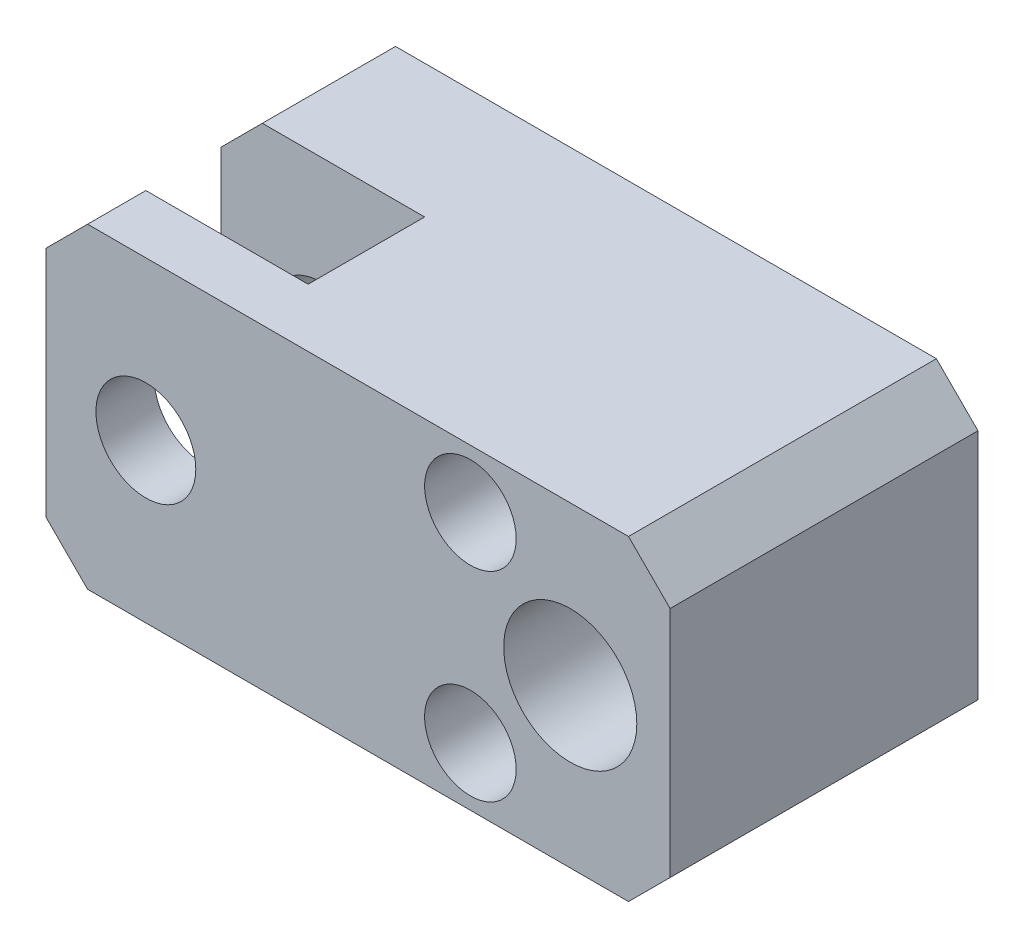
ISO-10303-21;
HEADER;
FILE_DESCRIPTION(('STEP AP214'),'2;1');
FILE_NAME('part.step','',(''),(''),'','','');
FILE_SCHEMA(('AUTOMOTIVE_DESIGN { 1 0 10303 214 1 1 1 1 }'));
ENDSEC;
DATA;
#1=APPLICATION_CONTEXT('core data for automotive mechanical design processes');
#2=APPLICATION_PROTOCOL_DEFINITION('international standard','automotive_design',2000,#1);
#3=PRODUCT_CONTEXT('',#1,'mechanical');
#4=PRODUCT('Part','Part','',(#3));
#5=PRODUCT_RELATED_PRODUCT_CATEGORY('part','',(#4));
#6=PRODUCT_DEFINITION_FORMATION('','',#4);
#7=PRODUCT_DEFINITION_CONTEXT('part definition',#1,'design');
#8=PRODUCT_DEFINITION('design','',#6,#7);
#9=PRODUCT_DEFINITION_SHAPE('','',#8);
#10=(LENGTH_UNIT() NAMED_UNIT(*) SI_UNIT(.MILLI.,.METRE.));
#11=(NAMED_UNIT(*) PLANE_ANGLE_UNIT() SI_UNIT($,.RADIAN.));
#12=(NAMED_UNIT(*) SI_UNIT($,.STERADIAN.) SOLID_ANGLE_UNIT());
#13=UNCERTAINTY_MEASURE_WITH_UNIT(LENGTH_MEASURE(1.E-05),#10,'distance_accuracy_value','');
#14=(GEOMETRIC_REPRESENTATION_CONTEXT(3) GLOBAL_UNCERTAINTY_ASSIGNED_CONTEXT((#13)) GLOBAL_UNIT_ASSIGNED_CONTEXT((#10,
#11,#12)) REPRESENTATION_CONTEXT('',''));
#15=CARTESIAN_POINT('',(0.,0.,0.));
#16=DIRECTION('',(0.,0.,1.));
#17=DIRECTION('',(1.,0.,0.));
#18=AXIS2_PLACEMENT_3D('',#15,#16,#17);
#19=CARTESIAN_POINT('',(-26.5,31.,30.));
#20=DIRECTION('',(1.,0.,0.));
#21=DIRECTION('',(0.,1.,0.));
#22=AXIS2_PLACEMENT_3D('',#19,#20,#21);
#23=PLANE('',#22);
#24=DIRECTION('',(0.,0.,1.));
#25=VECTOR('',#24,1.);
#26=CARTESIAN_POINT('',(-26.5,-7.,30.));
#27=LINE('',#26,#25);
#28=CARTESIAN_POINT('',(-26.5,-7.,16.));
#29=VERTEX_POINT('',#28);
#30=CARTESIAN_POINT('',(-26.5,-7.,30.));
#31=VERTEX_POINT('',#30);
#32=EDGE_CURVE('E127',#29,#31,#27,.T.);
#33=ORIENTED_EDGE('',*,*,#32,.T.);
#34=DIRECTION('',(0.,-1.,0.));
#35=VECTOR('',#34,1.);
#36=CARTESIAN_POINT('',(-26.5,31.,30.));
#37=LINE('',#36,#35);
#38=CARTESIAN_POINT('',(-26.5,31.,30.));
#39=VERTEX_POINT('',#38);
#40=EDGE_CURVE('E135',#39,#31,#37,.T.);
#41=ORIENTED_EDGE('',*,*,#40,.F.);
#42=DIRECTION('',(0.,0.,1.));
#43=VECTOR('',#42,1.);
#44=CARTESIAN_POINT('',(-26.5,31.,30.));
#45=LINE('',#44,#43);
#46=CARTESIAN_POINT('',(-26.5,31.,16.));
#47=VERTEX_POINT('',#46);
#48=EDGE_CURVE('E134',#47,#39,#45,.T.);
#49=ORIENTED_EDGE('',*,*,#48,.F.);
#50=DIRECTION('',(0.,-1.,0.));
#51=VECTOR('',#50,1.);
#52=CARTESIAN_POINT('',(-26.5,31.,16.));
#53=LINE('',#52,#51);
#54=EDGE_CURVE('E119',#47,#29,#53,.T.);
#55=ORIENTED_EDGE('',*,*,#54,.T.);
#56=EDGE_LOOP('',(#33,#41,#49,#55));
#57=FACE_BOUND('',#56,.T.);
#58=ADVANCED_FACE('F14',(#57),#23,.F.);
#59=CARTESIAN_POINT('',(-51.,31.,0.));
#60=DIRECTION('',(-1.,0.,0.));
#61=DIRECTION('',(0.,-1.,0.));
#62=AXIS2_PLACEMENT_3D('',#59,#60,#61);
#63=PLANE('',#62);
#64=DIRECTION('',(0.,-1.,0.));
#65=VECTOR('',#64,1.);
#66=CARTESIAN_POINT('',(-51.,-7.,37.));
#67=LINE('',#66,#65);
#68=CARTESIAN_POINT('',(-51.,26.,37.));
#69=VERTEX_POINT('',#68);
#70=CARTESIAN_POINT('',(-51.,-2.,37.));
#71=VERTEX_POINT('',#70);
#72=EDGE_CURVE('E159',#69,#71,#67,.T.);
#73=ORIENTED_EDGE('',*,*,#72,.F.);
#74=DIRECTION('',(0.,0.,-1.));
#75=VECTOR('',#74,1.);
#76=CARTESIAN_POINT('',(-51.,26.,30.));
#77=LINE('',#76,#75);
#78=CARTESIAN_POINT('',(-51.,26.,30.));
#79=VERTEX_POINT('',#78);
#80=EDGE_CURVE('E35',#69,#79,#77,.T.);
#81=ORIENTED_EDGE('',*,*,#80,.T.);
#82=DIRECTION('',(0.,-1.,0.));
#83=VECTOR('',#82,1.);
#84=CARTESIAN_POINT('',(-51.,31.,30.));
#85=LINE('',#84,#83);
#86=CARTESIAN_POINT('',(-51.,-2.,30.));
#87=VERTEX_POINT('',#86);
#88=EDGE_CURVE('E149',#79,#87,#85,.T.);
#89=ORIENTED_EDGE('',*,*,#88,.T.);
#90=DIRECTION('',(0.,0.,1.));
#91=VECTOR('',#90,1.);
#92=CARTESIAN_POINT('',(-51.,-2.,37.));
#93=LINE('',#92,#91);
#94=EDGE_CURVE('E228',#87,#71,#93,.T.);
#95=ORIENTED_EDGE('',*,*,#94,.T.);
#96=EDGE_LOOP('',(#73,#81,#89,#95));
#97=FACE_BOUND('',#96,.T.);
#98=ADVANCED_FACE('F231',(#97),#63,.T.);
#99=CARTESIAN_POINT('',(24.,-7.,0.));
#100=DIRECTION('',(0.,0.,1.));
#101=DIRECTION('',(1.,0.,0.));
#102=AXIS2_PLACEMENT_3D('',#99,#100,#101);
#103=PLANE('',#102);
#104=CARTESIAN_POINT('',(0.,24.,0.));
#105=DIRECTION('',(0.,0.,1.));
#106=DIRECTION('',(1.,0.,0.));
#107=AXIS2_PLACEMENT_3D('',#104,#105,#106);
#108=CIRCLE('',#107,3.3);
#109=CARTESIAN_POINT('',(3.3,24.,0.));
#110=VERTEX_POINT('',#109);
#111=EDGE_CURVE('E270',#110,#110,#108,.T.);
#112=ORIENTED_EDGE('',*,*,#111,.T.);
#113=EDGE_LOOP('',(#112));
#114=FACE_BOUND('',#113,.T.);
#115=CARTESIAN_POINT('',(0.,0.,0.));
#116=DIRECTION('',(0.,0.,1.));
#117=DIRECTION('',(1.,0.,0.));
#118=AXIS2_PLACEMENT_3D('',#115,#116,#117);
#119=CIRCLE('',#118,3.3);
#120=CARTESIAN_POINT('',(3.3,0.,0.));
#121=VERTEX_POINT('',#120);
#122=EDGE_CURVE('E258',#121,#121,#119,.T.);
#123=ORIENTED_EDGE('',*,*,#122,.T.);
#124=EDGE_LOOP('',(#123));
#125=FACE_BOUND('',#124,.T.);
#126=DIRECTION('',(-1.,0.,0.));
#127=VECTOR('',#126,1.);
#128=CARTESIAN_POINT('',(24.,-7.,0.));
#129=LINE('',#128,#127);
#130=CARTESIAN_POINT('',(19.,-7.,0.));
#131=VERTEX_POINT('',#130);
#132=CARTESIAN_POINT('',(-46.,-7.,0.));
#133=VERTEX_POINT('',#132);
#134=EDGE_CURVE('E168',#131,#133,#129,.T.);
#135=ORIENTED_EDGE('',*,*,#134,.T.);
#136=DIRECTION('',(-0.707106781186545,0.70710678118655,0.));
#137=VECTOR('',#136,1.);
#138=CARTESIAN_POINT('',(-46.,-7.,0.));
#139=LINE('',#138,#137);
#140=CARTESIAN_POINT('',(-51.,-2.,0.));
#141=VERTEX_POINT('',#140);
#142=EDGE_CURVE('E197',#133,#141,#139,.T.);
#143=ORIENTED_EDGE('',*,*,#142,.T.);
#144=DIRECTION('',(0.,1.,0.));
#145=VECTOR('',#144,1.);
#146=CARTESIAN_POINT('',(-51.,-7.,0.));
#147=LINE('',#146,#145);
#148=CARTESIAN_POINT('',(-51.,26.,0.));
#149=VERTEX_POINT('',#148);
#150=EDGE_CURVE('E156',#141,#149,#147,.T.);
#151=ORIENTED_EDGE('',*,*,#150,.T.);
#152=DIRECTION('',(0.707106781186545,0.70710678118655,0.));
#153=VECTOR('',#152,1.);
#154=CARTESIAN_POINT('',(-46.,31.,0.));
#155=LINE('',#154,#153);
#156=CARTESIAN_POINT('',(-46.,31.,0.));
#157=VERTEX_POINT('',#156);
#158=EDGE_CURVE('E191',#149,#157,#155,.T.);
#159=ORIENTED_EDGE('',*,*,#158,.T.);
#160=DIRECTION('',(-1.,0.,0.));
#161=VECTOR('',#160,1.);
#162=CARTESIAN_POINT('',(24.,31.,0.));
#163=LINE('',#162,#161);
#164=CARTESIAN_POINT('',(19.,31.,0.));
#165=VERTEX_POINT('',#164);
#166=EDGE_CURVE('E177',#165,#157,#163,.T.);
#167=ORIENTED_EDGE('',*,*,#166,.F.);
#168=DIRECTION('',(-0.707106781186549,0.707106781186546,0.));
#169=VECTOR('',#168,1.);
#170=CARTESIAN_POINT('',(24.,26.,0.));
#171=LINE('',#170,#169);
#172=CARTESIAN_POINT('',(24.,26.,0.));
#173=VERTEX_POINT('',#172);
#174=EDGE_CURVE('E193',#165,#173,#171,.F.);
#175=ORIENTED_EDGE('',*,*,#174,.T.);
#176=DIRECTION('',(0.,1.,0.));
#177=VECTOR('',#176,1.);
#178=CARTESIAN_POINT('',(24.,-7.,0.));
#179=LINE('',#178,#177);
#180=CARTESIAN_POINT('',(24.,-2.,0.));
#181=VERTEX_POINT('',#180);
#182=EDGE_CURVE('E162',#181,#173,#179,.T.);
#183=ORIENTED_EDGE('',*,*,#182,.F.);
#184=DIRECTION('',(0.707106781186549,0.707106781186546,0.));
#185=VECTOR('',#184,1.);
#186=CARTESIAN_POINT('',(24.,-2.,0.));
#187=LINE('',#186,#185);
#188=EDGE_CURVE('E195',#181,#131,#187,.F.);
#189=ORIENTED_EDGE('',*,*,#188,.T.);
#190=EDGE_LOOP('',(#135,#143,#151,#159,#167,#175,#183,#189));
#191=FACE_BOUND('',#190,.T.);
#192=ADVANCED_FACE('F16',(#114,#125,#191),#103,.F.);
#193=CARTESIAN_POINT('',(24.,31.,37.));
#194=DIRECTION('',(0.,-1.,0.));
#195=DIRECTION('',(0.,0.,-1.));
#196=AXIS2_PLACEMENT_3D('',#193,#194,#195);
#197=PLANE('',#196);
#198=DIRECTION('',(-1.,0.,0.));
#199=VECTOR('',#198,1.);
#200=CARTESIAN_POINT('',(24.,31.,37.));
#201=LINE('',#200,#199);
#202=CARTESIAN_POINT('',(19.,31.,37.));
#203=VERTEX_POINT('',#202);
#204=CARTESIAN_POINT('',(-46.,31.,37.));
#205=VERTEX_POINT('',#204);
#206=EDGE_CURVE('E174',#203,#205,#201,.T.);
#207=ORIENTED_EDGE('',*,*,#206,.F.);
#208=DIRECTION('',(0.,0.,-1.));
#209=VECTOR('',#208,1.);
#210=CARTESIAN_POINT('',(19.,31.,37.));
#211=LINE('',#210,#209);
#212=EDGE_CURVE('E226',#203,#165,#211,.T.);
#213=ORIENTED_EDGE('',*,*,#212,.T.);
#214=ORIENTED_EDGE('',*,*,#166,.T.);
#215=DIRECTION('',(0.,0.,1.));
#216=VECTOR('',#215,1.);
#217=CARTESIAN_POINT('',(-46.,31.,16.));
#218=LINE('',#217,#216);
#219=CARTESIAN_POINT('',(-46.,31.,16.));
#220=VERTEX_POINT('',#219);
#221=EDGE_CURVE('E223',#157,#220,#218,.T.);
#222=ORIENTED_EDGE('',*,*,#221,.T.);
#223=DIRECTION('',(1.,0.,0.));
#224=VECTOR('',#223,1.);
#225=CARTESIAN_POINT('',(-51.,31.,16.));
#226=LINE('',#225,#224);
#227=EDGE_CURVE('E143',#220,#47,#226,.T.);
#228=ORIENTED_EDGE('',*,*,#227,.T.);
#229=ORIENTED_EDGE('',*,*,#48,.T.);
#230=DIRECTION('',(-1.,0.,0.));
#231=VECTOR('',#230,1.);
#232=CARTESIAN_POINT('',(-51.,31.,30.));
#233=LINE('',#232,#231);
#234=CARTESIAN_POINT('',(-46.,31.,30.));
#235=VERTEX_POINT('',#234);
#236=EDGE_CURVE('E140',#39,#235,#233,.T.);
#237=ORIENTED_EDGE('',*,*,#236,.T.);
#238=DIRECTION('',(0.,0.,1.));
#239=VECTOR('',#238,1.);
#240=CARTESIAN_POINT('',(-46.,31.,37.));
#241=LINE('',#240,#239);
#242=EDGE_CURVE('E220',#235,#205,#241,.T.);
#243=ORIENTED_EDGE('',*,*,#242,.T.);
#244=EDGE_LOOP('',(#207,#213,#214,#222,#228,#229,#237,#243));
#245=FACE_BOUND('',#244,.T.);
#246=ADVANCED_FACE('F332',(#245),#197,.F.);
#247=CARTESIAN_POINT('',(24.,-7.,37.));
#248=DIRECTION('',(0.,0.,-1.));
#249=DIRECTION('',(-1.,0.,0.));
#250=AXIS2_PLACEMENT_3D('',#247,#248,#249);
#251=PLANE('',#250);
#252=CARTESIAN_POINT('',(0.,24.,37.));
#253=DIRECTION('',(0.,0.,1.));
#254=DIRECTION('',(1.,0.,0.));
#255=AXIS2_PLACEMENT_3D('',#252,#253,#254);
#256=CIRCLE('',#255,5.5);
#257=CARTESIAN_POINT('',(5.5,24.,37.));
#258=VERTEX_POINT('',#257);
#259=EDGE_CURVE('E261',#258,#258,#256,.T.);
#260=ORIENTED_EDGE('',*,*,#259,.F.);
#261=EDGE_LOOP('',(#260));
#262=FACE_BOUND('',#261,.T.);
#263=CARTESIAN_POINT('',(0.,0.,37.));
#264=DIRECTION('',(0.,0.,1.));
#265=DIRECTION('',(1.,0.,0.));
#266=AXIS2_PLACEMENT_3D('',#263,#264,#265);
#267=CIRCLE('',#266,5.5);
#268=CARTESIAN_POINT('',(5.5,0.,37.));
#269=VERTEX_POINT('',#268);
#270=EDGE_CURVE('E249',#269,#269,#267,.T.);
#271=ORIENTED_EDGE('',*,*,#270,.F.);
#272=EDGE_LOOP('',(#271));
#273=FACE_BOUND('',#272,.T.);
#274=CARTESIAN_POINT('',(-39.,12.,37.));
#275=DIRECTION('',(0.,0.,1.));
#276=DIRECTION('',(1.,0.,0.));
#277=AXIS2_PLACEMENT_3D('',#274,#275,#276);
#278=CIRCLE('',#277,6.);
#279=CARTESIAN_POINT('',(-33.,12.,37.));
#280=VERTEX_POINT('',#279);
#281=EDGE_CURVE('E246',#280,#280,#278,.T.);
#282=ORIENTED_EDGE('',*,*,#281,.F.);
#283=EDGE_LOOP('',(#282));
#284=FACE_BOUND('',#283,.T.);
#285=CARTESIAN_POINT('',(12.,12.,37.));
#286=DIRECTION('',(0.,0.,1.));
#287=DIRECTION('',(1.,0.,0.));
#288=AXIS2_PLACEMENT_3D('',#285,#286,#287);
#289=CIRCLE('',#288,8.);
#290=CARTESIAN_POINT('',(20.,12.,37.));
#291=VERTEX_POINT('',#290);
#292=EDGE_CURVE('E150',#291,#291,#289,.T.);
#293=ORIENTED_EDGE('',*,*,#292,.F.);
#294=EDGE_LOOP('',(#293));
#295=FACE_BOUND('',#294,.T.);
#296=DIRECTION('',(-1.,0.,0.));
#297=VECTOR('',#296,1.);
#298=CARTESIAN_POINT('',(24.,-7.,37.));
#299=LINE('',#298,#297);
#300=CARTESIAN_POINT('',(19.,-7.,37.));
#301=VERTEX_POINT('',#300);
#302=CARTESIAN_POINT('',(-46.,-7.,37.));
#303=VERTEX_POINT('',#302);
#304=EDGE_CURVE('E171',#301,#303,#299,.T.);
#305=ORIENTED_EDGE('',*,*,#304,.F.);
#306=DIRECTION('',(-0.707106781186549,-0.707106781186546,0.));
#307=VECTOR('',#306,1.);
#308=CARTESIAN_POINT('',(24.,-2.,37.));
#309=LINE('',#308,#307);
#310=CARTESIAN_POINT('',(24.,-2.,37.));
#311=VERTEX_POINT('',#310);
#312=EDGE_CURVE('E218',#301,#311,#309,.F.);
#313=ORIENTED_EDGE('',*,*,#312,.T.);
#314=DIRECTION('',(0.,-1.,0.));
#315=VECTOR('',#314,1.);
#316=CARTESIAN_POINT('',(24.,-7.,37.));
#317=LINE('',#316,#315);
#318=CARTESIAN_POINT('',(24.,26.,37.));
#319=VERTEX_POINT('',#318);
#320=EDGE_CURVE('E165',#319,#311,#317,.T.);
#321=ORIENTED_EDGE('',*,*,#320,.F.);
#322=DIRECTION('',(0.707106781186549,-0.707106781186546,0.));
#323=VECTOR('',#322,1.);
#324=CARTESIAN_POINT('',(24.,26.,37.));
#325=LINE('',#324,#323);
#326=EDGE_CURVE('E216',#319,#203,#325,.F.);
#327=ORIENTED_EDGE('',*,*,#326,.T.);
#328=ORIENTED_EDGE('',*,*,#206,.T.);
#329=DIRECTION('',(-0.707106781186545,-0.70710678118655,0.));
#330=VECTOR('',#329,1.);
#331=CARTESIAN_POINT('',(-46.,31.,37.));
#332=LINE('',#331,#330);
#333=EDGE_CURVE('E214',#205,#69,#332,.T.);
#334=ORIENTED_EDGE('',*,*,#333,.T.);
#335=ORIENTED_EDGE('',*,*,#72,.T.);
#336=DIRECTION('',(0.707106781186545,-0.70710678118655,0.));
#337=VECTOR('',#336,1.);
#338=CARTESIAN_POINT('',(-46.,-7.,37.));
#339=LINE('',#338,#337);
#340=EDGE_CURVE('E212',#71,#303,#339,.T.);
#341=ORIENTED_EDGE('',*,*,#340,.T.);
#342=EDGE_LOOP('',(#305,#313,#321,#327,#328,#334,#335,#341));
#343=FACE_BOUND('',#342,.T.);
#344=ADVANCED_FACE('F236',(#262,#273,#284,#295,#343),#251,.F.);
#345=CARTESIAN_POINT('',(24.,-7.,37.));
#346=DIRECTION('',(0.,1.,0.));
#347=DIRECTION('',(0.,0.,1.));
#348=AXIS2_PLACEMENT_3D('',#345,#346,#347);
#349=PLANE('',#348);
#350=DIRECTION('',(1.,0.,0.));
#351=VECTOR('',#350,1.);
#352=CARTESIAN_POINT('',(-51.,-7.,16.));
#353=LINE('',#352,#351);
#354=CARTESIAN_POINT('',(-46.,-7.,16.));
#355=VERTEX_POINT('',#354);
#356=EDGE_CURVE('E114',#355,#29,#353,.T.);
#357=ORIENTED_EDGE('',*,*,#356,.F.);
#358=DIRECTION('',(0.,0.,-1.));
#359=VECTOR('',#358,1.);
#360=CARTESIAN_POINT('',(-46.,-7.,0.));
#361=LINE('',#360,#359);
#362=EDGE_CURVE('E189',#355,#133,#361,.T.);
#363=ORIENTED_EDGE('',*,*,#362,.T.);
#364=ORIENTED_EDGE('',*,*,#134,.F.);
#365=DIRECTION('',(0.,0.,1.));
#366=VECTOR('',#365,1.);
#367=CARTESIAN_POINT('',(19.,-7.,37.));
#368=LINE('',#367,#366);
#369=EDGE_CURVE('E187',#131,#301,#368,.T.);
#370=ORIENTED_EDGE('',*,*,#369,.T.);
#371=ORIENTED_EDGE('',*,*,#304,.T.);
#372=DIRECTION('',(0.,0.,-1.));
#373=VECTOR('',#372,1.);
#374=CARTESIAN_POINT('',(-46.,-7.,30.));
#375=LINE('',#374,#373);
#376=CARTESIAN_POINT('',(-46.,-7.,30.));
#377=VERTEX_POINT('',#376);
#378=EDGE_CURVE('E180',#303,#377,#375,.T.);
#379=ORIENTED_EDGE('',*,*,#378,.T.);
#380=DIRECTION('',(-1.,0.,0.));
#381=VECTOR('',#380,1.);
#382=CARTESIAN_POINT('',(-51.,-7.,30.));
#383=LINE('',#382,#381);
#384=EDGE_CURVE('E128',#31,#377,#383,.T.);
#385=ORIENTED_EDGE('',*,*,#384,.F.);
#386=ORIENTED_EDGE('',*,*,#32,.F.);
#387=EDGE_LOOP('',(#357,#363,#364,#370,#371,#379,#385,#386));
#388=FACE_BOUND('',#387,.T.);
#389=ADVANCED_FACE('F138',(#388),#349,.F.);
#390=CARTESIAN_POINT('',(24.,31.,0.));
#391=DIRECTION('',(-1.,0.,0.));
#392=DIRECTION('',(0.,-1.,0.));
#393=AXIS2_PLACEMENT_3D('',#390,#391,#392);
#394=PLANE('',#393);
#395=ORIENTED_EDGE('',*,*,#320,.T.);
#396=DIRECTION('',(0.,0.,-1.));
#397=VECTOR('',#396,1.);
#398=CARTESIAN_POINT('',(24.,-2.,0.));
#399=LINE('',#398,#397);
#400=EDGE_CURVE('E209',#311,#181,#399,.T.);
#401=ORIENTED_EDGE('',*,*,#400,.T.);
#402=ORIENTED_EDGE('',*,*,#182,.T.);
#403=DIRECTION('',(0.,0.,1.));
#404=VECTOR('',#403,1.);
#405=CARTESIAN_POINT('',(24.,26.,0.));
#406=LINE('',#405,#404);
#407=EDGE_CURVE('E206',#173,#319,#406,.T.);
#408=ORIENTED_EDGE('',*,*,#407,.T.);
#409=EDGE_LOOP('',(#395,#401,#402,#408));
#410=FACE_BOUND('',#409,.T.);
#411=ADVANCED_FACE('F341',(#410),#394,.F.);
#412=ORIENTED_EDGE('',*,*,#150,.F.);
#413=DIRECTION('',(0.,0.,1.));
#414=VECTOR('',#413,1.);
#415=CARTESIAN_POINT('',(-51.,-2.,16.));
#416=LINE('',#415,#414);
#417=CARTESIAN_POINT('',(-51.,-2.,16.));
#418=VERTEX_POINT('',#417);
#419=EDGE_CURVE('E201',#141,#418,#416,.T.);
#420=ORIENTED_EDGE('',*,*,#419,.T.);
#421=DIRECTION('',(0.,-1.,0.));
#422=VECTOR('',#421,1.);
#423=CARTESIAN_POINT('',(-51.,31.,16.));
#424=LINE('',#423,#422);
#425=CARTESIAN_POINT('',(-51.,26.,16.));
#426=VERTEX_POINT('',#425);
#427=EDGE_CURVE('E136',#426,#418,#424,.T.);
#428=ORIENTED_EDGE('',*,*,#427,.F.);
#429=DIRECTION('',(0.,0.,-1.));
#430=VECTOR('',#429,1.);
#431=CARTESIAN_POINT('',(-51.,26.,0.));
#432=LINE('',#431,#430);
#433=EDGE_CURVE('E199',#426,#149,#432,.T.);
#434=ORIENTED_EDGE('',*,*,#433,.T.);
#435=EDGE_LOOP('',(#412,#420,#428,#434));
#436=FACE_BOUND('',#435,.T.);
#437=ADVANCED_FACE('F298',(#436),#63,.T.);
#438=CARTESIAN_POINT('',(12.,12.,7.));
#439=DIRECTION('',(0.,0.,1.));
#440=DIRECTION('',(1.,0.,0.));
#441=AXIS2_PLACEMENT_3D('',#438,#439,#440);
#442=CYLINDRICAL_SURFACE('',#441,8.);
#443=ORIENTED_EDGE('',*,*,#292,.T.);
#444=EDGE_LOOP('',(#443));
#445=FACE_BOUND('',#444,.T.);
#446=CARTESIAN_POINT('',(12.,12.,7.));
#447=DIRECTION('',(0.,0.,1.));
#448=DIRECTION('',(1.,0.,0.));
#449=AXIS2_PLACEMENT_3D('',#446,#447,#448);
#450=CIRCLE('',#449,8.);
#451=CARTESIAN_POINT('',(20.,12.,7.));
#452=VERTEX_POINT('',#451);
#453=EDGE_CURVE('E273',#452,#452,#450,.F.);
#454=ORIENTED_EDGE('',*,*,#453,.T.);
#455=EDGE_LOOP('',(#454));
#456=FACE_BOUND('',#455,.T.);
#457=ADVANCED_FACE('F277',(#445,#456),#442,.F.);
#458=CARTESIAN_POINT('',(-51.,31.,30.));
#459=DIRECTION('',(0.,0.,1.));
#460=DIRECTION('',(0.,-1.,0.));
#461=AXIS2_PLACEMENT_3D('',#458,#459,#460);
#462=PLANE('',#461);
#463=CARTESIAN_POINT('',(-39.,12.,30.));
#464=DIRECTION('',(0.,0.,1.));
#465=DIRECTION('',(0.,-1.,0.));
#466=AXIS2_PLACEMENT_3D('',#463,#464,#465);
#467=CIRCLE('',#466,6.);
#468=CARTESIAN_POINT('',(-39.,6.,30.));
#469=VERTEX_POINT('',#468);
#470=EDGE_CURVE('E184',#469,#469,#467,.T.);
#471=ORIENTED_EDGE('',*,*,#470,.T.);
#472=EDGE_LOOP('',(#471));
#473=FACE_BOUND('',#472,.T.);
#474=ORIENTED_EDGE('',*,*,#88,.F.);
#475=DIRECTION('',(0.707106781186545,0.70710678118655,0.));
#476=VECTOR('',#475,1.);
#477=CARTESIAN_POINT('',(-46.,31.,30.));
#478=LINE('',#477,#476);
#479=EDGE_CURVE('E9',#79,#235,#478,.T.);
#480=ORIENTED_EDGE('',*,*,#479,.T.);
#481=ORIENTED_EDGE('',*,*,#236,.F.);
#482=ORIENTED_EDGE('',*,*,#40,.T.);
#483=ORIENTED_EDGE('',*,*,#384,.T.);
#484=DIRECTION('',(-0.707106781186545,0.70710678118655,0.));
#485=VECTOR('',#484,1.);
#486=CARTESIAN_POINT('',(-46.,-7.,30.));
#487=LINE('',#486,#485);
#488=EDGE_CURVE('E22',#377,#87,#487,.T.);
#489=ORIENTED_EDGE('',*,*,#488,.T.);
#490=EDGE_LOOP('',(#474,#480,#481,#482,#483,#489));
#491=FACE_BOUND('',#490,.T.);
#492=ADVANCED_FACE('F239',(#473,#491),#462,.F.);
#493=CARTESIAN_POINT('',(-51.,31.,16.));
#494=DIRECTION('',(0.,0.,-1.));
#495=DIRECTION('',(0.,1.,0.));
#496=AXIS2_PLACEMENT_3D('',#493,#494,#495);
#497=PLANE('',#496);
#498=CARTESIAN_POINT('',(-39.,12.,16.));
#499=DIRECTION('',(0.,0.,-1.));
#500=DIRECTION('',(0.,1.,0.));
#501=AXIS2_PLACEMENT_3D('',#498,#499,#500);
#502=CIRCLE('',#501,6.);
#503=CARTESIAN_POINT('',(-39.,18.,16.));
#504=VERTEX_POINT('',#503);
#505=EDGE_CURVE('E181',#504,#504,#502,.T.);
#506=ORIENTED_EDGE('',*,*,#505,.T.);
#507=EDGE_LOOP('',(#506));
#508=FACE_BOUND('',#507,.T.);
#509=ORIENTED_EDGE('',*,*,#427,.T.);
#510=DIRECTION('',(0.707106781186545,-0.70710678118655,0.));
#511=VECTOR('',#510,1.);
#512=CARTESIAN_POINT('',(-46.,-7.,16.));
#513=LINE('',#512,#511);
#514=EDGE_CURVE('E122',#418,#355,#513,.T.);
#515=ORIENTED_EDGE('',*,*,#514,.T.);
#516=ORIENTED_EDGE('',*,*,#356,.T.);
#517=ORIENTED_EDGE('',*,*,#54,.F.);
#518=ORIENTED_EDGE('',*,*,#227,.F.);
#519=DIRECTION('',(-0.707106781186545,-0.70710678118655,0.));
#520=VECTOR('',#519,1.);
#521=CARTESIAN_POINT('',(-46.,31.,16.));
#522=LINE('',#521,#520);
#523=EDGE_CURVE('E203',#220,#426,#522,.T.);
#524=ORIENTED_EDGE('',*,*,#523,.T.);
#525=EDGE_LOOP('',(#509,#515,#516,#517,#518,#524));
#526=FACE_BOUND('',#525,.T.);
#527=ADVANCED_FACE('F117',(#508,#526),#497,.F.);
#528=CARTESIAN_POINT('',(-39.,12.,8.5));
#529=DIRECTION('',(0.,0.,1.));
#530=DIRECTION('',(1.,0.,0.));
#531=AXIS2_PLACEMENT_3D('',#528,#529,#530);
#532=PLANE('',#531);
#533=CARTESIAN_POINT('',(-39.,12.,8.5));
#534=DIRECTION('',(0.,0.,1.));
#535=DIRECTION('',(1.,0.,0.));
#536=AXIS2_PLACEMENT_3D('',#533,#534,#535);
#537=CIRCLE('',#536,6.);
#538=CARTESIAN_POINT('',(-33.,12.,8.5));
#539=VERTEX_POINT('',#538);
#540=EDGE_CURVE('E185',#539,#539,#537,.T.);
#541=ORIENTED_EDGE('',*,*,#540,.T.);
#542=EDGE_LOOP('',(#541));
#543=FACE_BOUND('',#542,.T.);
#544=ADVANCED_FACE('F304',(#543),#532,.T.);
#545=CARTESIAN_POINT('',(-39.,12.,8.5));
#546=DIRECTION('',(0.,0.,1.));
#547=DIRECTION('',(1.,0.,0.));
#548=AXIS2_PLACEMENT_3D('',#545,#546,#547);
#549=CYLINDRICAL_SURFACE('',#548,6.);
#550=ORIENTED_EDGE('',*,*,#540,.F.);
#551=EDGE_LOOP('',(#550));
#552=FACE_BOUND('',#551,.T.);
#553=ORIENTED_EDGE('',*,*,#505,.F.);
#554=EDGE_LOOP('',(#553));
#555=FACE_BOUND('',#554,.T.);
#556=ADVANCED_FACE('F317',(#552,#555),#549,.F.);
#557=ORIENTED_EDGE('',*,*,#281,.T.);
#558=EDGE_LOOP('',(#557));
#559=FACE_BOUND('',#558,.T.);
#560=ORIENTED_EDGE('',*,*,#470,.F.);
#561=EDGE_LOOP('',(#560));
#562=FACE_BOUND('',#561,.T.);
#563=ADVANCED_FACE('F301',(#559,#562),#549,.F.);
#564=CARTESIAN_POINT('',(0.,0.,37.));
#565=DIRECTION('',(0.,0.,1.));
#566=DIRECTION('',(1.,0.,0.));
#567=AXIS2_PLACEMENT_3D('',#564,#565,#566);
#568=CYLINDRICAL_SURFACE('',#567,5.5);
#569=CARTESIAN_POINT('',(0.,0.,25.));
#570=DIRECTION('',(0.,0.,1.));
#571=DIRECTION('',(1.,0.,0.));
#572=AXIS2_PLACEMENT_3D('',#569,#570,#571);
#573=CIRCLE('',#572,5.5);
#574=CARTESIAN_POINT('',(5.5,0.,25.));
#575=VERTEX_POINT('',#574);
#576=EDGE_CURVE('E252',#575,#575,#573,.T.);
#577=ORIENTED_EDGE('',*,*,#576,.F.);
#578=EDGE_LOOP('',(#577));
#579=FACE_BOUND('',#578,.T.);
#580=ORIENTED_EDGE('',*,*,#270,.T.);
#581=EDGE_LOOP('',(#580));
#582=FACE_BOUND('',#581,.T.);
#583=ADVANCED_FACE('F316',(#579,#582),#568,.F.);
#584=CARTESIAN_POINT('',(0.,3.3,25.));
#585=DIRECTION('',(0.,0.,-1.));
#586=DIRECTION('',(-1.,0.,0.));
#587=AXIS2_PLACEMENT_3D('',#584,#585,#586);
#588=PLANE('',#587);
#589=CARTESIAN_POINT('',(0.,0.,25.));
#590=DIRECTION('',(0.,0.,1.));
#591=DIRECTION('',(1.,0.,0.));
#592=AXIS2_PLACEMENT_3D('',#589,#590,#591);
#593=CIRCLE('',#592,3.3);
#594=CARTESIAN_POINT('',(3.3,0.,25.));
#595=VERTEX_POINT('',#594);
#596=EDGE_CURVE('E255',#595,#595,#593,.T.);
#597=ORIENTED_EDGE('',*,*,#596,.F.);
#598=EDGE_LOOP('',(#597));
#599=FACE_BOUND('',#598,.T.);
#600=ORIENTED_EDGE('',*,*,#576,.T.);
#601=EDGE_LOOP('',(#600));
#602=FACE_BOUND('',#601,.T.);
#603=ADVANCED_FACE('F324',(#599,#602),#588,.F.);
#604=CARTESIAN_POINT('',(0.,0.,37.));
#605=DIRECTION('',(0.,0.,1.));
#606=DIRECTION('',(1.,0.,0.));
#607=AXIS2_PLACEMENT_3D('',#604,#605,#606);
#608=CYLINDRICAL_SURFACE('',#607,3.3);
#609=ORIENTED_EDGE('',*,*,#122,.F.);
#610=EDGE_LOOP('',(#609));
#611=FACE_BOUND('',#610,.T.);
#612=ORIENTED_EDGE('',*,*,#596,.T.);
#613=EDGE_LOOP('',(#612));
#614=FACE_BOUND('',#613,.T.);
#615=ADVANCED_FACE('F408',(#611,#614),#608,.F.);
#616=CARTESIAN_POINT('',(0.,24.,37.));
#617=DIRECTION('',(0.,0.,1.));
#618=DIRECTION('',(1.,0.,0.));
#619=AXIS2_PLACEMENT_3D('',#616,#617,#618);
#620=CYLINDRICAL_SURFACE('',#619,5.5);
#621=CARTESIAN_POINT('',(0.,24.,25.));
#622=DIRECTION('',(0.,0.,1.));
#623=DIRECTION('',(1.,0.,0.));
#624=AXIS2_PLACEMENT_3D('',#621,#622,#623);
#625=CIRCLE('',#624,5.5);
#626=CARTESIAN_POINT('',(5.5,24.,25.));
#627=VERTEX_POINT('',#626);
#628=EDGE_CURVE('E264',#627,#627,#625,.T.);
#629=ORIENTED_EDGE('',*,*,#628,.F.);
#630=EDGE_LOOP('',(#629));
#631=FACE_BOUND('',#630,.T.);
#632=ORIENTED_EDGE('',*,*,#259,.T.);
#633=EDGE_LOOP('',(#632));
#634=FACE_BOUND('',#633,.T.);
#635=ADVANCED_FACE('F404',(#631,#634),#620,.F.);
#636=CARTESIAN_POINT('',(0.,27.3,25.));
#637=DIRECTION('',(0.,0.,-1.));
#638=DIRECTION('',(-1.,0.,0.));
#639=AXIS2_PLACEMENT_3D('',#636,#637,#638);
#640=PLANE('',#639);
#641=CARTESIAN_POINT('',(0.,24.,25.));
#642=DIRECTION('',(0.,0.,1.));
#643=DIRECTION('',(1.,0.,0.));
#644=AXIS2_PLACEMENT_3D('',#641,#642,#643);
#645=CIRCLE('',#644,3.3);
#646=CARTESIAN_POINT('',(3.3,24.,25.));
#647=VERTEX_POINT('',#646);
#648=EDGE_CURVE('E267',#647,#647,#645,.T.);
#649=ORIENTED_EDGE('',*,*,#648,.F.);
#650=EDGE_LOOP('',(#649));
#651=FACE_BOUND('',#650,.T.);
#652=ORIENTED_EDGE('',*,*,#628,.T.);
#653=EDGE_LOOP('',(#652));
#654=FACE_BOUND('',#653,.T.);
#655=ADVANCED_FACE('F400',(#651,#654),#640,.F.);
#656=CARTESIAN_POINT('',(0.,24.,37.));
#657=DIRECTION('',(0.,0.,1.));
#658=DIRECTION('',(1.,0.,0.));
#659=AXIS2_PLACEMENT_3D('',#656,#657,#658);
#660=CYLINDRICAL_SURFACE('',#659,3.3);
#661=ORIENTED_EDGE('',*,*,#111,.F.);
#662=EDGE_LOOP('',(#661));
#663=FACE_BOUND('',#662,.T.);
#664=ORIENTED_EDGE('',*,*,#648,.T.);
#665=EDGE_LOOP('',(#664));
#666=FACE_BOUND('',#665,.T.);
#667=ADVANCED_FACE('F397',(#663,#666),#660,.F.);
#668=CARTESIAN_POINT('',(-46.,-7.,37.));
#669=DIRECTION('',(-0.70710678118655,-0.707106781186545,0.));
#670=DIRECTION('',(0.707106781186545,-0.70710678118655,0.));
#671=AXIS2_PLACEMENT_3D('',#668,#669,#670);
#672=PLANE('',#671);
#673=ORIENTED_EDGE('',*,*,#514,.F.);
#674=ORIENTED_EDGE('',*,*,#419,.F.);
#675=ORIENTED_EDGE('',*,*,#142,.F.);
#676=ORIENTED_EDGE('',*,*,#362,.F.);
#677=EDGE_LOOP('',(#673,#674,#675,#676));
#678=FACE_BOUND('',#677,.T.);
#679=ADVANCED_FACE('F361',(#678),#672,.T.);
#680=CARTESIAN_POINT('',(24.,-2.,0.));
#681=DIRECTION('',(-0.707106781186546,0.707106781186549,0.));
#682=DIRECTION('',(-0.707106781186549,-0.707106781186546,0.));
#683=AXIS2_PLACEMENT_3D('',#680,#681,#682);
#684=PLANE('',#683);
#685=ORIENTED_EDGE('',*,*,#312,.F.);
#686=ORIENTED_EDGE('',*,*,#369,.F.);
#687=ORIENTED_EDGE('',*,*,#188,.F.);
#688=ORIENTED_EDGE('',*,*,#400,.F.);
#689=EDGE_LOOP('',(#685,#686,#687,#688));
#690=FACE_BOUND('',#689,.T.);
#691=ADVANCED_FACE('F368',(#690),#684,.F.);
#692=CARTESIAN_POINT('',(24.,26.,0.));
#693=DIRECTION('',(-0.707106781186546,-0.707106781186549,0.));
#694=DIRECTION('',(0.707106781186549,-0.707106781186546,0.));
#695=AXIS2_PLACEMENT_3D('',#692,#693,#694);
#696=PLANE('',#695);
#697=ORIENTED_EDGE('',*,*,#174,.F.);
#698=ORIENTED_EDGE('',*,*,#212,.F.);
#699=ORIENTED_EDGE('',*,*,#326,.F.);
#700=ORIENTED_EDGE('',*,*,#407,.F.);
#701=EDGE_LOOP('',(#697,#698,#699,#700));
#702=FACE_BOUND('',#701,.T.);
#703=ADVANCED_FACE('F377',(#702),#696,.F.);
#704=CARTESIAN_POINT('',(-46.,31.,37.));
#705=DIRECTION('',(-0.70710678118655,0.707106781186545,0.));
#706=DIRECTION('',(-0.707106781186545,-0.70710678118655,0.));
#707=AXIS2_PLACEMENT_3D('',#704,#705,#706);
#708=PLANE('',#707);
#709=ORIENTED_EDGE('',*,*,#158,.F.);
#710=ORIENTED_EDGE('',*,*,#433,.F.);
#711=ORIENTED_EDGE('',*,*,#523,.F.);
#712=ORIENTED_EDGE('',*,*,#221,.F.);
#713=EDGE_LOOP('',(#709,#710,#711,#712));
#714=FACE_BOUND('',#713,.T.);
#715=ADVANCED_FACE('F380',(#714),#708,.T.);
#716=CARTESIAN_POINT('',(-46.,31.,37.));
#717=DIRECTION('',(-0.70710678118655,0.707106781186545,0.));
#718=DIRECTION('',(-0.707106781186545,-0.70710678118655,0.));
#719=AXIS2_PLACEMENT_3D('',#716,#717,#718);
#720=PLANE('',#719);
#721=ORIENTED_EDGE('',*,*,#479,.F.);
#722=ORIENTED_EDGE('',*,*,#80,.F.);
#723=ORIENTED_EDGE('',*,*,#333,.F.);
#724=ORIENTED_EDGE('',*,*,#242,.F.);
#725=EDGE_LOOP('',(#721,#722,#723,#724));
#726=FACE_BOUND('',#725,.T.);
#727=ADVANCED_FACE('F287',(#726),#720,.T.);
#728=CARTESIAN_POINT('',(-46.,-7.,37.));
#729=DIRECTION('',(-0.70710678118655,-0.707106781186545,0.));
#730=DIRECTION('',(0.707106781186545,-0.70710678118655,0.));
#731=AXIS2_PLACEMENT_3D('',#728,#729,#730);
#732=PLANE('',#731);
#733=ORIENTED_EDGE('',*,*,#340,.F.);
#734=ORIENTED_EDGE('',*,*,#94,.F.);
#735=ORIENTED_EDGE('',*,*,#488,.F.);
#736=ORIENTED_EDGE('',*,*,#378,.F.);
#737=EDGE_LOOP('',(#733,#734,#735,#736));
#738=FACE_BOUND('',#737,.T.);
#739=ADVANCED_FACE('F238',(#738),#732,.T.);
#740=CARTESIAN_POINT('',(12.,12.,7.));
#741=DIRECTION('',(0.,0.,1.));
#742=DIRECTION('',(1.,0.,0.));
#743=AXIS2_PLACEMENT_3D('',#740,#741,#742);
#744=PLANE('',#743);
#745=ORIENTED_EDGE('',*,*,#453,.F.);
#746=EDGE_LOOP('',(#745));
#747=FACE_BOUND('',#746,.T.);
#748=ADVANCED_FACE('F279',(#747),#744,.T.);
#749=CLOSED_SHELL('',(#58,#98,#192,#246,#344,#389,#411,#437,#457,#492,#527,#544,#556,#563,#583,
#603,#615,#635,#655,#667,#679,#691,#703,#715,#727,#739,#748));
#750=MANIFOLD_SOLID_BREP('B1',#749);
#751=ADVANCED_BREP_SHAPE_REPRESENTATION('',(#18,#750),#14);
#752=SHAPE_DEFINITION_REPRESENTATION(#9,#751);
ENDSEC;
END-ISO-10303-21;
